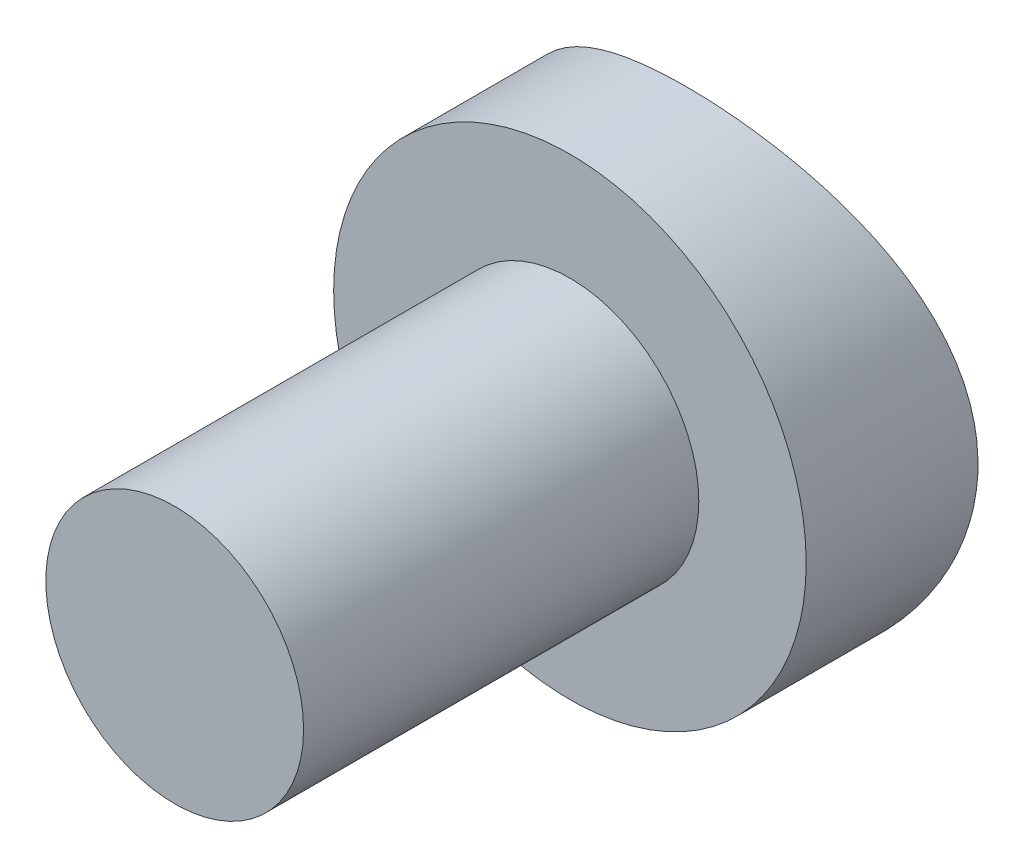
from build123d import *

# Parameters (mm, degrees)
SKETCH1_R           = 1.905
BOSS_EXTRUDE2_DEPTH = 8.382
SKETCH1_3_R         = 3.4925
SKETCH1_3_R_2       = 1.905
BOSS_EXTRUDE3_DEPTH = 2.54
CUT_EXTRUDE1_DEPTH  = 12.7
SKETCH3_R           = 8.0772
CUT_EXTRUDE2_DEPTH  = 0.4318


with BuildPart() as part:
    # Sketch1 → Boss-Extrude2 (new body)
    with BuildSketch(Plane.XY):
        Circle(SKETCH1_R)
    extrude(amount=BOSS_EXTRUDE2_DEPTH)

    # Sketch1_3 → Boss-Extrude3 (add)
    with BuildSketch(Plane.XY):
        Circle(SKETCH1_3_R)
        Circle(SKETCH1_3_R_2, mode=Mode.SUBTRACT)
    extrude(amount=BOSS_EXTRUDE3_DEPTH)

    # Sketch2 → Cut-Extrude1 (cut, symmetric)
    with BuildSketch(Plane(origin=(0, 0, 0), x_dir=(0, 0, -1), z_dir=(1, 0, 0))):
        with BuildLine():
            Line((-0.816924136, 3.4925), (1.981840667, 3.4925))
            Line((1.981840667, 3.4925), (1.981840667, -3.4925))
            Line((1.981840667, -3.4925), (-0.816924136, -3.4925))
            ThreePointArc((-0.816924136, -3.4925), (0, 0), (-0.816924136, 3.4925))
        make_face()
    extrude(amount=CUT_EXTRUDE1_DEPTH, both=True, mode=Mode.SUBTRACT)

    # Sketch3 → Cut-Extrude2 (cut, symmetric)
    with BuildSketch(Plane(origin=(0, 0, 0), x_dir=(0, 0, -1), z_dir=(1, 0, 0))):
        with Locations((6.501598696, 0)):
            Circle(SKETCH3_R)
    extrude(amount=CUT_EXTRUDE2_DEPTH, both=True, mode=Mode.SUBTRACT)


solid = part.part
